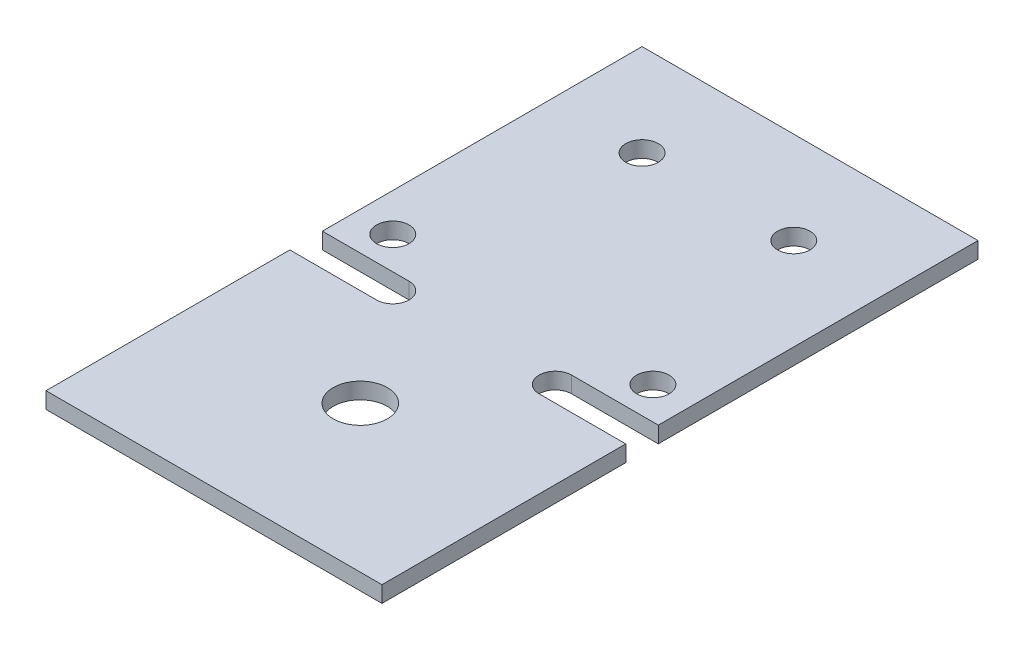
ISO-10303-21;
HEADER;
FILE_DESCRIPTION(('STEP AP214'),'2;1');
FILE_NAME('part.step','',(''),(''),'','','');
FILE_SCHEMA(('AUTOMOTIVE_DESIGN { 1 0 10303 214 1 1 1 1 }'));
ENDSEC;
DATA;
#1=APPLICATION_CONTEXT('core data for automotive mechanical design processes');
#2=APPLICATION_PROTOCOL_DEFINITION('international standard','automotive_design',2000,#1);
#3=PRODUCT_CONTEXT('',#1,'mechanical');
#4=PRODUCT('Part','Part','',(#3));
#5=PRODUCT_RELATED_PRODUCT_CATEGORY('part','',(#4));
#6=PRODUCT_DEFINITION_FORMATION('','',#4);
#7=PRODUCT_DEFINITION_CONTEXT('part definition',#1,'design');
#8=PRODUCT_DEFINITION('design','',#6,#7);
#9=PRODUCT_DEFINITION_SHAPE('','',#8);
#10=(LENGTH_UNIT() NAMED_UNIT(*) SI_UNIT(.MILLI.,.METRE.));
#11=(NAMED_UNIT(*) PLANE_ANGLE_UNIT() SI_UNIT($,.RADIAN.));
#12=(NAMED_UNIT(*) SI_UNIT($,.STERADIAN.) SOLID_ANGLE_UNIT());
#13=UNCERTAINTY_MEASURE_WITH_UNIT(LENGTH_MEASURE(1.E-05),#10,'distance_accuracy_value','');
#14=(GEOMETRIC_REPRESENTATION_CONTEXT(3) GLOBAL_UNCERTAINTY_ASSIGNED_CONTEXT((#13)) GLOBAL_UNIT_ASSIGNED_CONTEXT((#10,
#11,#12)) REPRESENTATION_CONTEXT('',''));
#15=CARTESIAN_POINT('',(0.,0.,0.));
#16=DIRECTION('',(0.,0.,1.));
#17=DIRECTION('',(1.,0.,0.));
#18=AXIS2_PLACEMENT_3D('',#15,#16,#17);
#19=CARTESIAN_POINT('',(16.,3.,-48.));
#20=DIRECTION('',(0.,1.,0.));
#21=DIRECTION('',(0.,0.,1.));
#22=AXIS2_PLACEMENT_3D('',#19,#20,#21);
#23=PLANE('',#22);
#24=CARTESIAN_POINT('',(7.,3.,-57.));
#25=DIRECTION('',(0.,1.,0.));
#26=DIRECTION('',(0.,0.,1.));
#27=AXIS2_PLACEMENT_3D('',#24,#25,#26);
#28=CIRCLE('',#27,3.);
#29=CARTESIAN_POINT('',(7.,3.,-54.));
#30=VERTEX_POINT('',#29);
#31=EDGE_CURVE('E308',#30,#30,#28,.T.);
#32=ORIENTED_EDGE('',*,*,#31,.F.);
#33=EDGE_LOOP('',(#32));
#34=FACE_BOUND('',#33,.T.);
#35=CARTESIAN_POINT('',(17.,3.,-93.));
#36=DIRECTION('',(0.,1.,0.));
#37=DIRECTION('',(0.,0.,1.));
#38=AXIS2_PLACEMENT_3D('',#35,#36,#37);
#39=CIRCLE('',#38,3.);
#40=CARTESIAN_POINT('',(17.,3.,-90.));
#41=VERTEX_POINT('',#40);
#42=EDGE_CURVE('E320',#41,#41,#39,.T.);
#43=ORIENTED_EDGE('',*,*,#42,.F.);
#44=EDGE_LOOP('',(#43));
#45=FACE_BOUND('',#44,.T.);
#46=DIRECTION('',(0.,0.,1.));
#47=VECTOR('',#46,1.);
#48=CARTESIAN_POINT('',(0.,3.,0.));
#49=LINE('',#48,#47);
#50=CARTESIAN_POINT('',(0.,3.,-45.));
#51=VERTEX_POINT('',#50);
#52=CARTESIAN_POINT('',(0.,3.,0.));
#53=VERTEX_POINT('',#52);
#54=EDGE_CURVE('E164',#51,#53,#49,.T.);
#55=ORIENTED_EDGE('',*,*,#54,.T.);
#56=DIRECTION('',(1.,0.,0.));
#57=VECTOR('',#56,1.);
#58=CARTESIAN_POINT('',(0.,3.,0.));
#59=LINE('',#58,#57);
#60=CARTESIAN_POINT('',(62.,3.,0.));
#61=VERTEX_POINT('',#60);
#62=EDGE_CURVE('E133',#53,#61,#59,.T.);
#63=ORIENTED_EDGE('',*,*,#62,.T.);
#64=DIRECTION('',(0.,0.,-1.));
#65=VECTOR('',#64,1.);
#66=CARTESIAN_POINT('',(62.,3.,0.));
#67=LINE('',#66,#65);
#68=CARTESIAN_POINT('',(62.,3.,-45.));
#69=VERTEX_POINT('',#68);
#70=EDGE_CURVE('E167',#61,#69,#67,.T.);
#71=ORIENTED_EDGE('',*,*,#70,.T.);
#72=DIRECTION('',(-1.,0.,0.));
#73=VECTOR('',#72,1.);
#74=CARTESIAN_POINT('',(46.,3.,-45.));
#75=LINE('',#74,#73);
#76=CARTESIAN_POINT('',(46.,3.,-45.));
#77=VERTEX_POINT('',#76);
#78=EDGE_CURVE('E169',#69,#77,#75,.T.);
#79=ORIENTED_EDGE('',*,*,#78,.T.);
#80=CARTESIAN_POINT('',(46.,3.,-48.));
#81=DIRECTION('',(0.,-1.,0.));
#82=DIRECTION('',(0.,0.,1.));
#83=AXIS2_PLACEMENT_3D('',#80,#81,#82);
#84=CIRCLE('',#83,3.);
#85=CARTESIAN_POINT('',(46.,3.,-51.));
#86=VERTEX_POINT('',#85);
#87=EDGE_CURVE('E171',#77,#86,#84,.T.);
#88=ORIENTED_EDGE('',*,*,#87,.T.);
#89=DIRECTION('',(1.,0.,0.));
#90=VECTOR('',#89,1.);
#91=CARTESIAN_POINT('',(46.,3.,-51.));
#92=LINE('',#91,#90);
#93=CARTESIAN_POINT('',(62.,3.,-51.));
#94=VERTEX_POINT('',#93);
#95=EDGE_CURVE('E173',#86,#94,#92,.T.);
#96=ORIENTED_EDGE('',*,*,#95,.T.);
#97=DIRECTION('',(0.,0.,-1.));
#98=VECTOR('',#97,1.);
#99=CARTESIAN_POINT('',(62.,3.,-51.));
#100=LINE('',#99,#98);
#101=CARTESIAN_POINT('',(62.,3.,-110.));
#102=VERTEX_POINT('',#101);
#103=EDGE_CURVE('E175',#94,#102,#100,.T.);
#104=ORIENTED_EDGE('',*,*,#103,.T.);
#105=DIRECTION('',(-1.,0.,0.));
#106=VECTOR('',#105,1.);
#107=CARTESIAN_POINT('',(0.,3.,-110.));
#108=LINE('',#107,#106);
#109=CARTESIAN_POINT('',(0.,3.,-110.));
#110=VERTEX_POINT('',#109);
#111=EDGE_CURVE('E177',#102,#110,#108,.T.);
#112=ORIENTED_EDGE('',*,*,#111,.T.);
#113=DIRECTION('',(0.,0.,1.));
#114=VECTOR('',#113,1.);
#115=CARTESIAN_POINT('',(0.,3.,-51.));
#116=LINE('',#115,#114);
#117=CARTESIAN_POINT('',(0.,3.,-51.));
#118=VERTEX_POINT('',#117);
#119=EDGE_CURVE('E179',#110,#118,#116,.T.);
#120=ORIENTED_EDGE('',*,*,#119,.T.);
#121=DIRECTION('',(1.,0.,0.));
#122=VECTOR('',#121,1.);
#123=CARTESIAN_POINT('',(0.,3.,-51.));
#124=LINE('',#123,#122);
#125=CARTESIAN_POINT('',(16.,3.,-51.));
#126=VERTEX_POINT('',#125);
#127=EDGE_CURVE('E181',#118,#126,#124,.T.);
#128=ORIENTED_EDGE('',*,*,#127,.T.);
#129=CARTESIAN_POINT('',(16.,3.,-48.));
#130=DIRECTION('',(0.,-1.,0.));
#131=DIRECTION('',(0.,0.,1.));
#132=AXIS2_PLACEMENT_3D('',#129,#130,#131);
#133=CIRCLE('',#132,3.);
#134=CARTESIAN_POINT('',(16.,3.,-45.));
#135=VERTEX_POINT('',#134);
#136=EDGE_CURVE('E50',#126,#135,#133,.T.);
#137=ORIENTED_EDGE('',*,*,#136,.T.);
#138=DIRECTION('',(-1.,0.,0.));
#139=VECTOR('',#138,1.);
#140=CARTESIAN_POINT('',(0.,3.,-45.));
#141=LINE('',#140,#139);
#142=EDGE_CURVE('E45',#135,#51,#141,.T.);
#143=ORIENTED_EDGE('',*,*,#142,.T.);
#144=EDGE_LOOP('',(#55,#63,#71,#79,#88,#96,#104,#112,#120,#128,#137,#143));
#145=FACE_BOUND('',#144,.T.);
#146=CARTESIAN_POINT('',(31.,3.,-27.));
#147=DIRECTION('',(0.,1.,0.));
#148=DIRECTION('',(0.,0.,1.));
#149=AXIS2_PLACEMENT_3D('',#146,#147,#148);
#150=CIRCLE('',#149,5.);
#151=CARTESIAN_POINT('',(31.,3.,-22.));
#152=VERTEX_POINT('',#151);
#153=EDGE_CURVE('E138',#152,#152,#150,.T.);
#154=ORIENTED_EDGE('',*,*,#153,.F.);
#155=EDGE_LOOP('',(#154));
#156=FACE_BOUND('',#155,.T.);
#157=CARTESIAN_POINT('',(45.,3.,-93.));
#158=DIRECTION('',(0.,1.,0.));
#159=DIRECTION('',(0.,0.,1.));
#160=AXIS2_PLACEMENT_3D('',#157,#158,#159);
#161=CIRCLE('',#160,3.);
#162=CARTESIAN_POINT('',(45.,3.,-90.));
#163=VERTEX_POINT('',#162);
#164=EDGE_CURVE('E314',#163,#163,#161,.T.);
#165=ORIENTED_EDGE('',*,*,#164,.F.);
#166=EDGE_LOOP('',(#165));
#167=FACE_BOUND('',#166,.T.);
#168=CARTESIAN_POINT('',(55.,3.,-57.));
#169=DIRECTION('',(0.,1.,0.));
#170=DIRECTION('',(0.,0.,1.));
#171=AXIS2_PLACEMENT_3D('',#168,#169,#170);
#172=CIRCLE('',#171,3.);
#173=CARTESIAN_POINT('',(55.,3.,-54.));
#174=VERTEX_POINT('',#173);
#175=EDGE_CURVE('E297',#174,#174,#172,.T.);
#176=ORIENTED_EDGE('',*,*,#175,.F.);
#177=EDGE_LOOP('',(#176));
#178=FACE_BOUND('',#177,.T.);
#179=ADVANCED_FACE('F30',(#34,#45,#145,#156,#167,#178),#23,.T.);
#180=CARTESIAN_POINT('',(16.,0.,-48.));
#181=DIRECTION('',(0.,1.,0.));
#182=DIRECTION('',(0.,0.,1.));
#183=AXIS2_PLACEMENT_3D('',#180,#181,#182);
#184=PLANE('',#183);
#185=CARTESIAN_POINT('',(7.,0.,-57.));
#186=DIRECTION('',(0.,1.,0.));
#187=DIRECTION('',(0.,0.,1.));
#188=AXIS2_PLACEMENT_3D('',#185,#186,#187);
#189=CIRCLE('',#188,3.);
#190=CARTESIAN_POINT('',(7.,0.,-54.));
#191=VERTEX_POINT('',#190);
#192=EDGE_CURVE('E303',#191,#191,#189,.T.);
#193=ORIENTED_EDGE('',*,*,#192,.T.);
#194=EDGE_LOOP('',(#193));
#195=FACE_BOUND('',#194,.T.);
#196=CARTESIAN_POINT('',(17.,0.,-93.));
#197=DIRECTION('',(0.,1.,0.));
#198=DIRECTION('',(0.,0.,1.));
#199=AXIS2_PLACEMENT_3D('',#196,#197,#198);
#200=CIRCLE('',#199,3.);
#201=CARTESIAN_POINT('',(17.,0.,-90.));
#202=VERTEX_POINT('',#201);
#203=EDGE_CURVE('E317',#202,#202,#200,.T.);
#204=ORIENTED_EDGE('',*,*,#203,.T.);
#205=EDGE_LOOP('',(#204));
#206=FACE_BOUND('',#205,.T.);
#207=DIRECTION('',(0.,0.,1.));
#208=VECTOR('',#207,1.);
#209=CARTESIAN_POINT('',(0.,0.,0.));
#210=LINE('',#209,#208);
#211=CARTESIAN_POINT('',(0.,0.,-45.));
#212=VERTEX_POINT('',#211);
#213=CARTESIAN_POINT('',(0.,0.,0.));
#214=VERTEX_POINT('',#213);
#215=EDGE_CURVE('E124',#212,#214,#210,.T.);
#216=ORIENTED_EDGE('',*,*,#215,.F.);
#217=DIRECTION('',(-1.,0.,0.));
#218=VECTOR('',#217,1.);
#219=CARTESIAN_POINT('',(0.,0.,-45.));
#220=LINE('',#219,#218);
#221=CARTESIAN_POINT('',(16.,0.,-45.));
#222=VERTEX_POINT('',#221);
#223=EDGE_CURVE('E162',#222,#212,#220,.T.);
#224=ORIENTED_EDGE('',*,*,#223,.F.);
#225=CARTESIAN_POINT('',(16.,0.,-48.));
#226=DIRECTION('',(0.,-1.,0.));
#227=DIRECTION('',(0.,0.,1.));
#228=AXIS2_PLACEMENT_3D('',#225,#226,#227);
#229=CIRCLE('',#228,3.);
#230=CARTESIAN_POINT('',(16.,0.,-51.));
#231=VERTEX_POINT('',#230);
#232=EDGE_CURVE('E160',#231,#222,#229,.T.);
#233=ORIENTED_EDGE('',*,*,#232,.F.);
#234=DIRECTION('',(1.,0.,0.));
#235=VECTOR('',#234,1.);
#236=CARTESIAN_POINT('',(0.,0.,-51.));
#237=LINE('',#236,#235);
#238=CARTESIAN_POINT('',(0.,0.,-51.));
#239=VERTEX_POINT('',#238);
#240=EDGE_CURVE('E158',#239,#231,#237,.T.);
#241=ORIENTED_EDGE('',*,*,#240,.F.);
#242=DIRECTION('',(0.,0.,1.));
#243=VECTOR('',#242,1.);
#244=CARTESIAN_POINT('',(0.,0.,-51.));
#245=LINE('',#244,#243);
#246=CARTESIAN_POINT('',(0.,0.,-110.));
#247=VERTEX_POINT('',#246);
#248=EDGE_CURVE('E156',#247,#239,#245,.T.);
#249=ORIENTED_EDGE('',*,*,#248,.F.);
#250=DIRECTION('',(-1.,0.,0.));
#251=VECTOR('',#250,1.);
#252=CARTESIAN_POINT('',(0.,0.,-110.));
#253=LINE('',#252,#251);
#254=CARTESIAN_POINT('',(62.,0.,-110.));
#255=VERTEX_POINT('',#254);
#256=EDGE_CURVE('E154',#255,#247,#253,.T.);
#257=ORIENTED_EDGE('',*,*,#256,.F.);
#258=DIRECTION('',(0.,0.,-1.));
#259=VECTOR('',#258,1.);
#260=CARTESIAN_POINT('',(62.,0.,-51.));
#261=LINE('',#260,#259);
#262=CARTESIAN_POINT('',(62.,0.,-51.));
#263=VERTEX_POINT('',#262);
#264=EDGE_CURVE('E152',#263,#255,#261,.T.);
#265=ORIENTED_EDGE('',*,*,#264,.F.);
#266=DIRECTION('',(1.,0.,0.));
#267=VECTOR('',#266,1.);
#268=CARTESIAN_POINT('',(46.,0.,-51.));
#269=LINE('',#268,#267);
#270=CARTESIAN_POINT('',(46.,0.,-51.));
#271=VERTEX_POINT('',#270);
#272=EDGE_CURVE('E150',#271,#263,#269,.T.);
#273=ORIENTED_EDGE('',*,*,#272,.F.);
#274=CARTESIAN_POINT('',(46.,0.,-48.));
#275=DIRECTION('',(0.,-1.,0.));
#276=DIRECTION('',(0.,0.,1.));
#277=AXIS2_PLACEMENT_3D('',#274,#275,#276);
#278=CIRCLE('',#277,3.);
#279=CARTESIAN_POINT('',(46.,0.,-45.));
#280=VERTEX_POINT('',#279);
#281=EDGE_CURVE('E148',#280,#271,#278,.T.);
#282=ORIENTED_EDGE('',*,*,#281,.F.);
#283=DIRECTION('',(-1.,0.,0.));
#284=VECTOR('',#283,1.);
#285=CARTESIAN_POINT('',(46.,0.,-45.));
#286=LINE('',#285,#284);
#287=CARTESIAN_POINT('',(62.,0.,-45.));
#288=VERTEX_POINT('',#287);
#289=EDGE_CURVE('E146',#288,#280,#286,.T.);
#290=ORIENTED_EDGE('',*,*,#289,.F.);
#291=DIRECTION('',(0.,0.,-1.));
#292=VECTOR('',#291,1.);
#293=CARTESIAN_POINT('',(62.,0.,0.));
#294=LINE('',#293,#292);
#295=CARTESIAN_POINT('',(62.,0.,0.));
#296=VERTEX_POINT('',#295);
#297=EDGE_CURVE('E126',#296,#288,#294,.T.);
#298=ORIENTED_EDGE('',*,*,#297,.F.);
#299=DIRECTION('',(1.,0.,0.));
#300=VECTOR('',#299,1.);
#301=CARTESIAN_POINT('',(0.,0.,0.));
#302=LINE('',#301,#300);
#303=EDGE_CURVE('E119',#214,#296,#302,.T.);
#304=ORIENTED_EDGE('',*,*,#303,.F.);
#305=EDGE_LOOP('',(#216,#224,#233,#241,#249,#257,#265,#273,#282,#290,#298,#304));
#306=FACE_BOUND('',#305,.T.);
#307=CARTESIAN_POINT('',(31.,0.,-27.));
#308=DIRECTION('',(0.,1.,0.));
#309=DIRECTION('',(0.,0.,1.));
#310=AXIS2_PLACEMENT_3D('',#307,#308,#309);
#311=CIRCLE('',#310,5.);
#312=CARTESIAN_POINT('',(31.,0.,-22.));
#313=VERTEX_POINT('',#312);
#314=EDGE_CURVE('E141',#313,#313,#311,.T.);
#315=ORIENTED_EDGE('',*,*,#314,.T.);
#316=EDGE_LOOP('',(#315));
#317=FACE_BOUND('',#316,.T.);
#318=CARTESIAN_POINT('',(45.,0.,-93.));
#319=DIRECTION('',(0.,1.,0.));
#320=DIRECTION('',(0.,0.,1.));
#321=AXIS2_PLACEMENT_3D('',#318,#319,#320);
#322=CIRCLE('',#321,3.);
#323=CARTESIAN_POINT('',(45.,0.,-90.));
#324=VERTEX_POINT('',#323);
#325=EDGE_CURVE('E311',#324,#324,#322,.T.);
#326=ORIENTED_EDGE('',*,*,#325,.T.);
#327=EDGE_LOOP('',(#326));
#328=FACE_BOUND('',#327,.T.);
#329=CARTESIAN_POINT('',(55.,0.,-57.));
#330=DIRECTION('',(0.,1.,0.));
#331=DIRECTION('',(0.,0.,1.));
#332=AXIS2_PLACEMENT_3D('',#329,#330,#331);
#333=CIRCLE('',#332,3.);
#334=CARTESIAN_POINT('',(55.,0.,-54.));
#335=VERTEX_POINT('',#334);
#336=EDGE_CURVE('E300',#335,#335,#333,.T.);
#337=ORIENTED_EDGE('',*,*,#336,.T.);
#338=EDGE_LOOP('',(#337));
#339=FACE_BOUND('',#338,.T.);
#340=ADVANCED_FACE('F120',(#195,#206,#306,#317,#328,#339),#184,.F.);
#341=CARTESIAN_POINT('',(0.,3.,0.));
#342=DIRECTION('',(1.,0.,0.));
#343=DIRECTION('',(0.,0.,-1.));
#344=AXIS2_PLACEMENT_3D('',#341,#342,#343);
#345=PLANE('',#344);
#346=ORIENTED_EDGE('',*,*,#215,.T.);
#347=DIRECTION('',(0.,-1.,0.));
#348=VECTOR('',#347,1.);
#349=CARTESIAN_POINT('',(0.,3.,0.));
#350=LINE('',#349,#348);
#351=EDGE_CURVE('E11',#53,#214,#350,.T.);
#352=ORIENTED_EDGE('',*,*,#351,.F.);
#353=ORIENTED_EDGE('',*,*,#54,.F.);
#354=DIRECTION('',(0.,-1.,0.));
#355=VECTOR('',#354,1.);
#356=CARTESIAN_POINT('',(0.,3.,-45.));
#357=LINE('',#356,#355);
#358=EDGE_CURVE('E137',#51,#212,#357,.T.);
#359=ORIENTED_EDGE('',*,*,#358,.T.);
#360=EDGE_LOOP('',(#346,#352,#353,#359));
#361=FACE_BOUND('',#360,.T.);
#362=ADVANCED_FACE('F32',(#361),#345,.F.);
#363=CARTESIAN_POINT('',(0.,3.,0.));
#364=DIRECTION('',(0.,0.,-1.));
#365=DIRECTION('',(-1.,0.,0.));
#366=AXIS2_PLACEMENT_3D('',#363,#364,#365);
#367=PLANE('',#366);
#368=ORIENTED_EDGE('',*,*,#303,.T.);
#369=DIRECTION('',(0.,-1.,0.));
#370=VECTOR('',#369,1.);
#371=CARTESIAN_POINT('',(62.,3.,0.));
#372=LINE('',#371,#370);
#373=EDGE_CURVE('E38',#61,#296,#372,.T.);
#374=ORIENTED_EDGE('',*,*,#373,.F.);
#375=ORIENTED_EDGE('',*,*,#62,.F.);
#376=ORIENTED_EDGE('',*,*,#351,.T.);
#377=EDGE_LOOP('',(#368,#374,#375,#376));
#378=FACE_BOUND('',#377,.T.);
#379=ADVANCED_FACE('F132',(#378),#367,.F.);
#380=CARTESIAN_POINT('',(62.,3.,0.));
#381=DIRECTION('',(-1.,0.,0.));
#382=DIRECTION('',(0.,0.,1.));
#383=AXIS2_PLACEMENT_3D('',#380,#381,#382);
#384=PLANE('',#383);
#385=ORIENTED_EDGE('',*,*,#297,.T.);
#386=DIRECTION('',(0.,-1.,0.));
#387=VECTOR('',#386,1.);
#388=CARTESIAN_POINT('',(62.,3.,-45.));
#389=LINE('',#388,#387);
#390=EDGE_CURVE('E210',#69,#288,#389,.T.);
#391=ORIENTED_EDGE('',*,*,#390,.F.);
#392=ORIENTED_EDGE('',*,*,#70,.F.);
#393=ORIENTED_EDGE('',*,*,#373,.T.);
#394=EDGE_LOOP('',(#385,#391,#392,#393));
#395=FACE_BOUND('',#394,.T.);
#396=ADVANCED_FACE('F214',(#395),#384,.F.);
#397=CARTESIAN_POINT('',(46.,3.,-45.));
#398=DIRECTION('',(0.,0.,1.));
#399=DIRECTION('',(1.,0.,0.));
#400=AXIS2_PLACEMENT_3D('',#397,#398,#399);
#401=PLANE('',#400);
#402=ORIENTED_EDGE('',*,*,#289,.T.);
#403=DIRECTION('',(0.,-1.,0.));
#404=VECTOR('',#403,1.);
#405=CARTESIAN_POINT('',(46.,3.,-45.));
#406=LINE('',#405,#404);
#407=EDGE_CURVE('E207',#77,#280,#406,.T.);
#408=ORIENTED_EDGE('',*,*,#407,.F.);
#409=ORIENTED_EDGE('',*,*,#78,.F.);
#410=ORIENTED_EDGE('',*,*,#390,.T.);
#411=EDGE_LOOP('',(#402,#408,#409,#410));
#412=FACE_BOUND('',#411,.T.);
#413=ADVANCED_FACE('F222',(#412),#401,.F.);
#414=CARTESIAN_POINT('',(46.,3.,-48.));
#415=DIRECTION('',(0.,-1.,0.));
#416=DIRECTION('',(0.,0.,-1.));
#417=AXIS2_PLACEMENT_3D('',#414,#415,#416);
#418=CYLINDRICAL_SURFACE('',#417,3.);
#419=ORIENTED_EDGE('',*,*,#281,.T.);
#420=DIRECTION('',(0.,-1.,0.));
#421=VECTOR('',#420,1.);
#422=CARTESIAN_POINT('',(46.,3.,-51.));
#423=LINE('',#422,#421);
#424=EDGE_CURVE('E204',#86,#271,#423,.T.);
#425=ORIENTED_EDGE('',*,*,#424,.F.);
#426=ORIENTED_EDGE('',*,*,#87,.F.);
#427=ORIENTED_EDGE('',*,*,#407,.T.);
#428=EDGE_LOOP('',(#419,#425,#426,#427));
#429=FACE_BOUND('',#428,.T.);
#430=ADVANCED_FACE('F225',(#429),#418,.F.);
#431=CARTESIAN_POINT('',(46.,3.,-51.));
#432=DIRECTION('',(0.,0.,-1.));
#433=DIRECTION('',(-1.,0.,0.));
#434=AXIS2_PLACEMENT_3D('',#431,#432,#433);
#435=PLANE('',#434);
#436=ORIENTED_EDGE('',*,*,#272,.T.);
#437=DIRECTION('',(0.,-1.,0.));
#438=VECTOR('',#437,1.);
#439=CARTESIAN_POINT('',(62.,3.,-51.));
#440=LINE('',#439,#438);
#441=EDGE_CURVE('E201',#94,#263,#440,.T.);
#442=ORIENTED_EDGE('',*,*,#441,.F.);
#443=ORIENTED_EDGE('',*,*,#95,.F.);
#444=ORIENTED_EDGE('',*,*,#424,.T.);
#445=EDGE_LOOP('',(#436,#442,#443,#444));
#446=FACE_BOUND('',#445,.T.);
#447=ADVANCED_FACE('F230',(#446),#435,.F.);
#448=CARTESIAN_POINT('',(62.,3.,-51.));
#449=DIRECTION('',(-1.,0.,0.));
#450=DIRECTION('',(0.,0.,1.));
#451=AXIS2_PLACEMENT_3D('',#448,#449,#450);
#452=PLANE('',#451);
#453=ORIENTED_EDGE('',*,*,#264,.T.);
#454=DIRECTION('',(0.,-1.,0.));
#455=VECTOR('',#454,1.);
#456=CARTESIAN_POINT('',(62.,3.,-110.));
#457=LINE('',#456,#455);
#458=EDGE_CURVE('E198',#102,#255,#457,.T.);
#459=ORIENTED_EDGE('',*,*,#458,.F.);
#460=ORIENTED_EDGE('',*,*,#103,.F.);
#461=ORIENTED_EDGE('',*,*,#441,.T.);
#462=EDGE_LOOP('',(#453,#459,#460,#461));
#463=FACE_BOUND('',#462,.T.);
#464=ADVANCED_FACE('F236',(#463),#452,.F.);
#465=CARTESIAN_POINT('',(0.,3.,-110.));
#466=DIRECTION('',(0.,0.,1.));
#467=DIRECTION('',(1.,0.,0.));
#468=AXIS2_PLACEMENT_3D('',#465,#466,#467);
#469=PLANE('',#468);
#470=ORIENTED_EDGE('',*,*,#256,.T.);
#471=DIRECTION('',(0.,-1.,0.));
#472=VECTOR('',#471,1.);
#473=CARTESIAN_POINT('',(0.,3.,-110.));
#474=LINE('',#473,#472);
#475=EDGE_CURVE('E195',#110,#247,#474,.T.);
#476=ORIENTED_EDGE('',*,*,#475,.F.);
#477=ORIENTED_EDGE('',*,*,#111,.F.);
#478=ORIENTED_EDGE('',*,*,#458,.T.);
#479=EDGE_LOOP('',(#470,#476,#477,#478));
#480=FACE_BOUND('',#479,.T.);
#481=ADVANCED_FACE('F240',(#480),#469,.F.);
#482=CARTESIAN_POINT('',(0.,3.,-51.));
#483=DIRECTION('',(1.,0.,0.));
#484=DIRECTION('',(0.,0.,-1.));
#485=AXIS2_PLACEMENT_3D('',#482,#483,#484);
#486=PLANE('',#485);
#487=ORIENTED_EDGE('',*,*,#248,.T.);
#488=DIRECTION('',(0.,-1.,0.));
#489=VECTOR('',#488,1.);
#490=CARTESIAN_POINT('',(0.,3.,-51.));
#491=LINE('',#490,#489);
#492=EDGE_CURVE('E192',#118,#239,#491,.T.);
#493=ORIENTED_EDGE('',*,*,#492,.F.);
#494=ORIENTED_EDGE('',*,*,#119,.F.);
#495=ORIENTED_EDGE('',*,*,#475,.T.);
#496=EDGE_LOOP('',(#487,#493,#494,#495));
#497=FACE_BOUND('',#496,.T.);
#498=ADVANCED_FACE('F245',(#497),#486,.F.);
#499=CARTESIAN_POINT('',(0.,3.,-51.));
#500=DIRECTION('',(0.,0.,-1.));
#501=DIRECTION('',(-1.,0.,0.));
#502=AXIS2_PLACEMENT_3D('',#499,#500,#501);
#503=PLANE('',#502);
#504=ORIENTED_EDGE('',*,*,#240,.T.);
#505=DIRECTION('',(0.,-1.,0.));
#506=VECTOR('',#505,1.);
#507=CARTESIAN_POINT('',(16.,3.,-51.));
#508=LINE('',#507,#506);
#509=EDGE_CURVE('E189',#126,#231,#508,.T.);
#510=ORIENTED_EDGE('',*,*,#509,.F.);
#511=ORIENTED_EDGE('',*,*,#127,.F.);
#512=ORIENTED_EDGE('',*,*,#492,.T.);
#513=EDGE_LOOP('',(#504,#510,#511,#512));
#514=FACE_BOUND('',#513,.T.);
#515=ADVANCED_FACE('F249',(#514),#503,.F.);
#516=CARTESIAN_POINT('',(16.,3.,-48.));
#517=DIRECTION('',(0.,-1.,0.));
#518=DIRECTION('',(0.,0.,-1.));
#519=AXIS2_PLACEMENT_3D('',#516,#517,#518);
#520=CYLINDRICAL_SURFACE('',#519,3.);
#521=ORIENTED_EDGE('',*,*,#232,.T.);
#522=DIRECTION('',(0.,-1.,0.));
#523=VECTOR('',#522,1.);
#524=CARTESIAN_POINT('',(16.,3.,-45.));
#525=LINE('',#524,#523);
#526=EDGE_CURVE('E186',#135,#222,#525,.T.);
#527=ORIENTED_EDGE('',*,*,#526,.F.);
#528=ORIENTED_EDGE('',*,*,#136,.F.);
#529=ORIENTED_EDGE('',*,*,#509,.T.);
#530=EDGE_LOOP('',(#521,#527,#528,#529));
#531=FACE_BOUND('',#530,.T.);
#532=ADVANCED_FACE('F253',(#531),#520,.F.);
#533=CARTESIAN_POINT('',(0.,3.,-45.));
#534=DIRECTION('',(0.,0.,1.));
#535=DIRECTION('',(1.,0.,0.));
#536=AXIS2_PLACEMENT_3D('',#533,#534,#535);
#537=PLANE('',#536);
#538=ORIENTED_EDGE('',*,*,#223,.T.);
#539=ORIENTED_EDGE('',*,*,#358,.F.);
#540=ORIENTED_EDGE('',*,*,#142,.F.);
#541=ORIENTED_EDGE('',*,*,#526,.T.);
#542=EDGE_LOOP('',(#538,#539,#540,#541));
#543=FACE_BOUND('',#542,.T.);
#544=ADVANCED_FACE('F255',(#543),#537,.F.);
#545=CARTESIAN_POINT('',(31.,3.,-27.));
#546=DIRECTION('',(0.,-1.,0.));
#547=DIRECTION('',(0.,0.,-1.));
#548=AXIS2_PLACEMENT_3D('',#545,#546,#547);
#549=CYLINDRICAL_SURFACE('',#548,5.);
#550=ORIENTED_EDGE('',*,*,#153,.T.);
#551=EDGE_LOOP('',(#550));
#552=FACE_BOUND('',#551,.T.);
#553=ORIENTED_EDGE('',*,*,#314,.F.);
#554=EDGE_LOOP('',(#553));
#555=FACE_BOUND('',#554,.T.);
#556=ADVANCED_FACE('F257',(#552,#555),#549,.F.);
#557=CARTESIAN_POINT('',(17.,3.,-93.));
#558=DIRECTION('',(0.,-1.,0.));
#559=DIRECTION('',(0.,0.,-1.));
#560=AXIS2_PLACEMENT_3D('',#557,#558,#559);
#561=CYLINDRICAL_SURFACE('',#560,3.);
#562=ORIENTED_EDGE('',*,*,#42,.T.);
#563=EDGE_LOOP('',(#562));
#564=FACE_BOUND('',#563,.T.);
#565=ORIENTED_EDGE('',*,*,#203,.F.);
#566=EDGE_LOOP('',(#565));
#567=FACE_BOUND('',#566,.T.);
#568=ADVANCED_FACE('F263',(#564,#567),#561,.F.);
#569=CARTESIAN_POINT('',(45.,3.,-93.));
#570=DIRECTION('',(0.,-1.,0.));
#571=DIRECTION('',(0.,0.,-1.));
#572=AXIS2_PLACEMENT_3D('',#569,#570,#571);
#573=CYLINDRICAL_SURFACE('',#572,3.);
#574=ORIENTED_EDGE('',*,*,#164,.T.);
#575=EDGE_LOOP('',(#574));
#576=FACE_BOUND('',#575,.T.);
#577=ORIENTED_EDGE('',*,*,#325,.F.);
#578=EDGE_LOOP('',(#577));
#579=FACE_BOUND('',#578,.T.);
#580=ADVANCED_FACE('F280',(#576,#579),#573,.F.);
#581=CARTESIAN_POINT('',(7.,3.,-57.));
#582=DIRECTION('',(0.,-1.,0.));
#583=DIRECTION('',(0.,0.,-1.));
#584=AXIS2_PLACEMENT_3D('',#581,#582,#583);
#585=CYLINDRICAL_SURFACE('',#584,3.);
#586=ORIENTED_EDGE('',*,*,#31,.T.);
#587=EDGE_LOOP('',(#586));
#588=FACE_BOUND('',#587,.T.);
#589=ORIENTED_EDGE('',*,*,#192,.F.);
#590=EDGE_LOOP('',(#589));
#591=FACE_BOUND('',#590,.T.);
#592=ADVANCED_FACE('F284',(#588,#591),#585,.F.);
#593=CARTESIAN_POINT('',(55.,3.,-57.));
#594=DIRECTION('',(0.,-1.,0.));
#595=DIRECTION('',(0.,0.,-1.));
#596=AXIS2_PLACEMENT_3D('',#593,#594,#595);
#597=CYLINDRICAL_SURFACE('',#596,3.);
#598=ORIENTED_EDGE('',*,*,#175,.T.);
#599=EDGE_LOOP('',(#598));
#600=FACE_BOUND('',#599,.T.);
#601=ORIENTED_EDGE('',*,*,#336,.F.);
#602=EDGE_LOOP('',(#601));
#603=FACE_BOUND('',#602,.T.);
#604=ADVANCED_FACE('F288',(#600,#603),#597,.F.);
#605=CLOSED_SHELL('',(#179,#340,#362,#379,#396,#413,#430,#447,#464,#481,#498,#515,#532,#544,
#556,#568,#580,#592,#604));
#606=MANIFOLD_SOLID_BREP('B2',#605);
#607=ADVANCED_BREP_SHAPE_REPRESENTATION('',(#18,#606),#14);
#608=SHAPE_DEFINITION_REPRESENTATION(#9,#607);
ENDSEC;
END-ISO-10303-21;
